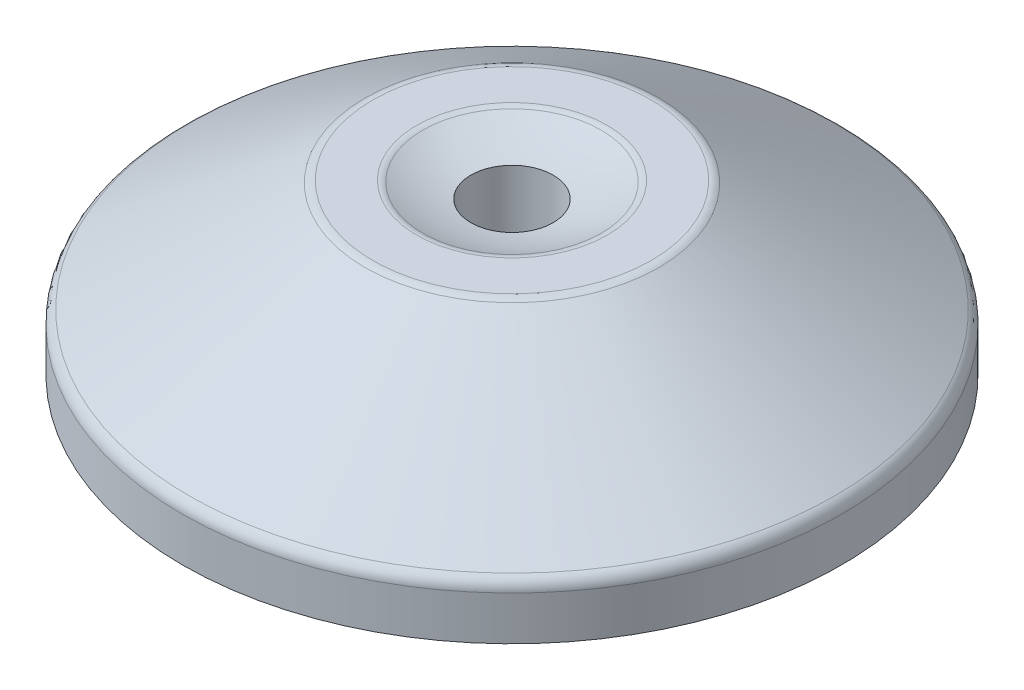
ISO-10303-21;
HEADER;
FILE_DESCRIPTION(('STEP AP214'),'2;1');
FILE_NAME('part.step','',(''),(''),'','','');
FILE_SCHEMA(('AUTOMOTIVE_DESIGN { 1 0 10303 214 1 1 1 1 }'));
ENDSEC;
DATA;
#1=APPLICATION_CONTEXT('core data for automotive mechanical design processes');
#2=APPLICATION_PROTOCOL_DEFINITION('international standard','automotive_design',2000,#1);
#3=PRODUCT_CONTEXT('',#1,'mechanical');
#4=PRODUCT('Part','Part','',(#3));
#5=PRODUCT_RELATED_PRODUCT_CATEGORY('part','',(#4));
#6=PRODUCT_DEFINITION_FORMATION('','',#4);
#7=PRODUCT_DEFINITION_CONTEXT('part definition',#1,'design');
#8=PRODUCT_DEFINITION('design','',#6,#7);
#9=PRODUCT_DEFINITION_SHAPE('','',#8);
#10=(LENGTH_UNIT() NAMED_UNIT(*) SI_UNIT(.MILLI.,.METRE.));
#11=(NAMED_UNIT(*) PLANE_ANGLE_UNIT() SI_UNIT($,.RADIAN.));
#12=(NAMED_UNIT(*) SI_UNIT($,.STERADIAN.) SOLID_ANGLE_UNIT());
#13=UNCERTAINTY_MEASURE_WITH_UNIT(LENGTH_MEASURE(1.E-05),#10,'distance_accuracy_value','');
#14=(GEOMETRIC_REPRESENTATION_CONTEXT(3) GLOBAL_UNCERTAINTY_ASSIGNED_CONTEXT((#13)) GLOBAL_UNIT_ASSIGNED_CONTEXT((#10,
#11,#12)) REPRESENTATION_CONTEXT('',''));
#15=CARTESIAN_POINT('',(0.,0.,0.));
#16=DIRECTION('',(0.,0.,1.));
#17=DIRECTION('',(1.,0.,0.));
#18=AXIS2_PLACEMENT_3D('',#15,#16,#17);
#19=CARTESIAN_POINT('',(14.6875,12.5447967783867,0.));
#20=DIRECTION('',(0.,-1.,0.));
#21=DIRECTION('',(0.,0.,-1.));
#22=AXIS2_PLACEMENT_3D('',#19,#20,#21);
#23=PLANE('',#22);
#24=CARTESIAN_POINT('',(0.,12.5447967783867,0.));
#25=DIRECTION('',(0.,-1.,0.));
#26=DIRECTION('',(0.,0.,-1.));
#27=AXIS2_PLACEMENT_3D('',#24,#25,#26);
#28=CIRCLE('',#27,8.37499999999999);
#29=CARTESIAN_POINT('',(0.,12.5447967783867,-8.37499999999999));
#30=VERTEX_POINT('',#29);
#31=EDGE_CURVE('E18',#30,#30,#28,.T.);
#32=ORIENTED_EDGE('',*,*,#31,.F.);
#33=EDGE_LOOP('',(#32));
#34=FACE_BOUND('',#33,.T.);
#35=CARTESIAN_POINT('',(0.,12.5447967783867,0.));
#36=DIRECTION('',(0.,-1.,0.));
#37=DIRECTION('',(0.,0.,-1.));
#38=AXIS2_PLACEMENT_3D('',#35,#36,#37);
#39=CIRCLE('',#38,21.);
#40=CARTESIAN_POINT('',(0.,12.5447967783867,-21.));
#41=VERTEX_POINT('',#40);
#42=EDGE_CURVE('E91',#41,#41,#39,.F.);
#43=ORIENTED_EDGE('',*,*,#42,.F.);
#44=EDGE_LOOP('',(#43));
#45=FACE_BOUND('',#44,.T.);
#46=ADVANCED_FACE('F14',(#34,#45),#23,.T.);
#47=CARTESIAN_POINT('',(0.,12.5447967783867,0.));
#48=DIRECTION('',(0.,-1.,0.));
#49=DIRECTION('',(0.,0.,-1.));
#50=AXIS2_PLACEMENT_3D('',#47,#48,#49);
#51=TOROIDAL_SURFACE('',#50,5.62499999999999,2.75);
#52=ORIENTED_EDGE('',*,*,#31,.T.);
#53=EDGE_LOOP('',(#52));
#54=FACE_BOUND('',#53,.T.);
#55=CARTESIAN_POINT('',(0.,9.79479677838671,0.));
#56=DIRECTION('',(0.,-1.,0.));
#57=DIRECTION('',(0.,0.,-1.));
#58=AXIS2_PLACEMENT_3D('',#55,#56,#57);
#59=CIRCLE('',#58,5.62499999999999);
#60=CARTESIAN_POINT('',(0.,9.79479677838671,-5.62499999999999));
#61=VERTEX_POINT('',#60);
#62=EDGE_CURVE('E86',#61,#61,#59,.F.);
#63=ORIENTED_EDGE('',*,*,#62,.T.);
#64=EDGE_LOOP('',(#63));
#65=FACE_BOUND('',#64,.T.);
#66=ADVANCED_FACE('F99',(#54,#65),#51,.T.);
#67=CARTESIAN_POINT('',(0.,-13.0000726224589,0.));
#68=DIRECTION('',(0.,-1.,0.));
#69=DIRECTION('',(0.,0.,-1.));
#70=AXIS2_PLACEMENT_3D('',#67,#68,#69);
#71=DEGENERATE_TOROIDAL_SURFACE('',#70,12.248537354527,27.0023786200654,.T.);
#72=CARTESIAN_POINT('',(0.,3.,0.));
#73=DIRECTION('',(0.,-1.,0.));
#74=DIRECTION('',(0.,0.,-1.));
#75=AXIS2_PLACEMENT_3D('',#72,#73,#74);
#76=CIRCLE('',#75,34.);
#77=CARTESIAN_POINT('',(0.,3.,-34.));
#78=VERTEX_POINT('',#77);
#79=EDGE_CURVE('E77',#78,#78,#76,.T.);
#80=ORIENTED_EDGE('',*,*,#79,.T.);
#81=EDGE_LOOP('',(#80));
#82=FACE_BOUND('',#81,.T.);
#83=ORIENTED_EDGE('',*,*,#42,.T.);
#84=EDGE_LOOP('',(#83));
#85=FACE_BOUND('',#84,.T.);
#86=ADVANCED_FACE('F16',(#82,#85),#71,.F.);
#87=CARTESIAN_POINT('',(0.,15.2947967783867,0.));
#88=DIRECTION('',(0.,-1.,0.));
#89=DIRECTION('',(0.,0.,-1.));
#90=AXIS2_PLACEMENT_3D('',#87,#88,#89);
#91=CYLINDRICAL_SURFACE('',#90,5.62499999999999);
#92=ORIENTED_EDGE('',*,*,#62,.F.);
#93=EDGE_LOOP('',(#92));
#94=FACE_BOUND('',#93,.T.);
#95=CARTESIAN_POINT('',(0.,20.7947967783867,0.));
#96=DIRECTION('',(0.,-1.,0.));
#97=DIRECTION('',(0.,0.,-1.));
#98=AXIS2_PLACEMENT_3D('',#95,#96,#97);
#99=CIRCLE('',#98,5.62499999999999);
#100=CARTESIAN_POINT('',(0.,20.7947967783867,-5.62499999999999));
#101=VERTEX_POINT('',#100);
#102=EDGE_CURVE('E85',#101,#101,#99,.T.);
#103=ORIENTED_EDGE('',*,*,#102,.F.);
#104=EDGE_LOOP('',(#103));
#105=FACE_BOUND('',#104,.T.);
#106=ADVANCED_FACE('F103',(#94,#105),#91,.F.);
#107=CARTESIAN_POINT('',(0.,1.5,0.));
#108=DIRECTION('',(0.,-1.,0.));
#109=DIRECTION('',(0.,0.,-1.));
#110=AXIS2_PLACEMENT_3D('',#107,#108,#109);
#111=CYLINDRICAL_SURFACE('',#110,34.);
#112=CARTESIAN_POINT('',(0.,0.,0.));
#113=DIRECTION('',(0.,-1.,0.));
#114=DIRECTION('',(0.,0.,-1.));
#115=AXIS2_PLACEMENT_3D('',#112,#113,#114);
#116=CIRCLE('',#115,34.);
#117=CARTESIAN_POINT('',(0.,0.,-34.));
#118=VERTEX_POINT('',#117);
#119=EDGE_CURVE('E164',#118,#118,#116,.F.);
#120=ORIENTED_EDGE('',*,*,#119,.F.);
#121=EDGE_LOOP('',(#120));
#122=FACE_BOUND('',#121,.T.);
#123=ORIENTED_EDGE('',*,*,#79,.F.);
#124=EDGE_LOOP('',(#123));
#125=FACE_BOUND('',#124,.T.);
#126=ADVANCED_FACE('F179',(#122,#125),#111,.F.);
#127=CARTESIAN_POINT('',(-11.3274938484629,25.3562402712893,-12.4182138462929));
#128=CARTESIAN_POINT('',(-11.2256653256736,25.3114638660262,-12.4182138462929));
#129=CARTESIAN_POINT('',(-11.1238368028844,25.2666874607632,-12.4182138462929));
#130=CARTESIAN_POINT('',(0.,20.3752738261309,-12.4182138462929));
#131=CARTESIAN_POINT('',(11.1238368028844,25.2666874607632,-12.4182138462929));
#132=CARTESIAN_POINT('',(11.2256653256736,25.3114638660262,-12.4182138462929));
#133=CARTESIAN_POINT('',(11.3274938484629,25.3562402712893,-12.4182138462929));
#134=CARTESIAN_POINT('',(-11.3476147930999,25.3114638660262,-12.3065802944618));
#135=CARTESIAN_POINT('',(-11.2456053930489,25.2666079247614,-12.3065802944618));
#136=CARTESIAN_POINT('',(-11.143595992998,25.2217519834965,-12.3065802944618));
#137=CARTESIAN_POINT('',(0.,20.3216497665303,-12.3065802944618));
#138=CARTESIAN_POINT('',(11.143595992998,25.2217519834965,-12.3065802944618));
#139=CARTESIAN_POINT('',(11.245605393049,25.2666079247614,-12.3065802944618));
#140=CARTESIAN_POINT('',(11.3476147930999,25.3114638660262,-12.3065802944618));
#141=CARTESIAN_POINT('',(-11.367735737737,25.2666874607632,-12.1949467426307));
#142=CARTESIAN_POINT('',(-11.2655454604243,25.2217519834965,-12.1949467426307));
#143=CARTESIAN_POINT('',(-11.1633551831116,25.1768165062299,-12.1949467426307));
#144=CARTESIAN_POINT('',(0.,20.2680257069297,-12.1949467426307));
#145=CARTESIAN_POINT('',(11.1633551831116,25.1768165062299,-12.1949467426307));
#146=CARTESIAN_POINT('',(11.2655454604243,25.2217519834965,-12.1949467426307));
#147=CARTESIAN_POINT('',(11.367735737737,25.2666874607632,-12.1949467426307));
#148=CARTESIAN_POINT('',(-13.5657653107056,20.3752738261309,0.));
#149=CARTESIAN_POINT('',(-13.4438158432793,20.3216497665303,0.));
#150=CARTESIAN_POINT('',(-13.321866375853,20.2680257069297,0.));
#151=CARTESIAN_POINT('',(0.,14.4100865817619,0.));
#152=CARTESIAN_POINT('',(13.321866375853,20.2680257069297,0.));
#153=CARTESIAN_POINT('',(13.4438158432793,20.3216497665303,0.));
#154=CARTESIAN_POINT('',(13.5657653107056,20.3752738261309,0.));
#155=CARTESIAN_POINT('',(-11.367735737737,25.2666874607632,12.1949467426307));
#156=CARTESIAN_POINT('',(-11.2655454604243,25.2217519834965,12.1949467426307));
#157=CARTESIAN_POINT('',(-11.1633551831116,25.1768165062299,12.1949467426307));
#158=CARTESIAN_POINT('',(0.,20.2680257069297,12.1949467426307));
#159=CARTESIAN_POINT('',(11.1633551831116,25.1768165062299,12.1949467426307));
#160=CARTESIAN_POINT('',(11.2655454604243,25.2217519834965,12.1949467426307));
#161=CARTESIAN_POINT('',(11.367735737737,25.2666874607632,12.1949467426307));
#162=CARTESIAN_POINT('',(-11.3476147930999,25.3114638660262,12.3065802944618));
#163=CARTESIAN_POINT('',(-11.2456053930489,25.2666079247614,12.3065802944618));
#164=CARTESIAN_POINT('',(-11.143595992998,25.2217519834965,12.3065802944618));
#165=CARTESIAN_POINT('',(0.,20.3216497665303,12.3065802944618));
#166=CARTESIAN_POINT('',(11.143595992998,25.2217519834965,12.3065802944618));
#167=CARTESIAN_POINT('',(11.245605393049,25.2666079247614,12.3065802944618));
#168=CARTESIAN_POINT('',(11.3476147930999,25.3114638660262,12.3065802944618));
#169=CARTESIAN_POINT('',(-11.3274938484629,25.3562402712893,12.4182138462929));
#170=CARTESIAN_POINT('',(-11.2256653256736,25.3114638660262,12.4182138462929));
#171=CARTESIAN_POINT('',(-11.1238368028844,25.2666874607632,12.4182138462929));
#172=CARTESIAN_POINT('',(0.,20.3752738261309,12.4182138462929));
#173=CARTESIAN_POINT('',(11.1238368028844,25.2666874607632,12.4182138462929));
#174=CARTESIAN_POINT('',(11.2256653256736,25.3114638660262,12.4182138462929));
#175=CARTESIAN_POINT('',(11.3274938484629,25.3562402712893,12.4182138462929));
#176=(BOUNDED_SURFACE() B_SPLINE_SURFACE(2,2,((#127,#128,#129,#130,#131,#132,#133),(#134,#135,
#136,#137,#138,#139,#140),(#141,#142,#143,#144,#145,#146,#147),(#148,#149,#150,#151,#152,#153,
#154),(#155,#156,#157,#158,#159,#160,#161),(#162,#163,#164,#165,#166,#167,#168),(#169,#170,#171,
#172,#173,#174,#175)),.UNSPECIFIED.,.F.,.F.,.F.) B_SPLINE_SURFACE_WITH_KNOTS((3,2,2,3),(3,2,2,
3),(-0.422560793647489,-0.414275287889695,0.414275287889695,0.422560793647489),
(-0.00828550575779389,0.,0.828550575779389,0.836836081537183),
.UNSPECIFIED.) GEOMETRIC_REPRESENTATION_ITEM() RATIONAL_B_SPLINE_SURFACE(((1.,1.,1.,
0.915408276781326,1.,1.,1.),(1.,1.,1.,0.915408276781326,1.,1.,1.),(1.,1.,1.,0.915408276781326,
1.,1.,1.),(0.915408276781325,0.915408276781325,0.915408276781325,0.837972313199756,
0.915408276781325,0.915408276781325,0.915408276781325),(1.,1.,1.,0.915408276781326,1.,1.,1.),
(1.,1.,1.,0.915408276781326,1.,1.,1.),(1.,1.,1.,0.915408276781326,1.,1.,1.))) REPRESENTATION_ITEM('') SURFACE());
#177=CARTESIAN_POINT('',(0.,22.8308165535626,0.));
#178=DIRECTION('',(0.,-1.,0.));
#179=DIRECTION('',(0.,0.,-1.));
#180=AXIS2_PLACEMENT_3D('',#177,#178,#179);
#181=CIRCLE('',#180,12.1949467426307);
#182=CARTESIAN_POINT('',(0.,22.8308165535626,-12.1949467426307));
#183=VERTEX_POINT('',#182);
#184=EDGE_CURVE('E162',#183,#183,#181,.T.);
#185=ORIENTED_EDGE('',*,*,#102,.T.);
#186=EDGE_LOOP('',(#185));
#187=FACE_BOUND('',#186,.T.);
#188=ORIENTED_EDGE('',*,*,#184,.F.);
#189=EDGE_LOOP('',(#188));
#190=FACE_BOUND('',#189,.T.);
#191=ADVANCED_FACE('F182',(#187,#190),#176,.T.);
#192=CARTESIAN_POINT('',(39.5,0.,0.));
#193=DIRECTION('',(0.,-1.,0.));
#194=DIRECTION('',(0.,0.,-1.));
#195=AXIS2_PLACEMENT_3D('',#192,#193,#194);
#196=PLANE('',#195);
#197=ORIENTED_EDGE('',*,*,#119,.T.);
#198=EDGE_LOOP('',(#197));
#199=FACE_BOUND('',#198,.T.);
#200=CARTESIAN_POINT('',(0.,0.,0.));
#201=DIRECTION('',(0.,-1.,0.));
#202=DIRECTION('',(0.,0.,-1.));
#203=AXIS2_PLACEMENT_3D('',#200,#201,#202);
#204=CIRCLE('',#203,45.);
#205=CARTESIAN_POINT('',(0.,0.,-45.));
#206=VERTEX_POINT('',#205);
#207=EDGE_CURVE('E96',#206,#206,#204,.F.);
#208=ORIENTED_EDGE('',*,*,#207,.F.);
#209=EDGE_LOOP('',(#208));
#210=FACE_BOUND('',#209,.T.);
#211=ADVANCED_FACE('F71',(#199,#210),#196,.T.);
#212=CARTESIAN_POINT('',(0.,21.,0.));
#213=DIRECTION('',(0.,-1.,0.));
#214=DIRECTION('',(0.,0.,-1.));
#215=AXIS2_PLACEMENT_3D('',#212,#213,#214);
#216=TOROIDAL_SURFACE('',#215,13.,2.);
#217=ORIENTED_EDGE('',*,*,#184,.T.);
#218=EDGE_LOOP('',(#217));
#219=FACE_BOUND('',#218,.T.);
#220=CARTESIAN_POINT('',(0.,23.,0.));
#221=DIRECTION('',(0.,1.,0.));
#222=DIRECTION('',(1.,0.,0.));
#223=AXIS2_PLACEMENT_3D('',#220,#221,#222);
#224=CIRCLE('',#223,13.);
#225=CARTESIAN_POINT('',(13.,23.,0.));
#226=VERTEX_POINT('',#225);
#227=EDGE_CURVE('E125',#226,#226,#224,.F.);
#228=ORIENTED_EDGE('',*,*,#227,.F.);
#229=EDGE_LOOP('',(#228));
#230=FACE_BOUND('',#229,.T.);
#231=ADVANCED_FACE('F65',(#219,#230),#216,.T.);
#232=CARTESIAN_POINT('',(0.,3.,0.));
#233=DIRECTION('',(0.,-1.,0.));
#234=DIRECTION('',(0.,0.,-1.));
#235=AXIS2_PLACEMENT_3D('',#232,#233,#234);
#236=CYLINDRICAL_SURFACE('',#235,45.);
#237=CARTESIAN_POINT('',(0.,6.,0.));
#238=DIRECTION('',(0.,-1.,0.));
#239=DIRECTION('',(0.,0.,-1.));
#240=AXIS2_PLACEMENT_3D('',#237,#238,#239);
#241=CIRCLE('',#240,45.);
#242=CARTESIAN_POINT('',(0.,6.,-45.));
#243=VERTEX_POINT('',#242);
#244=EDGE_CURVE('E123',#243,#243,#241,.F.);
#245=ORIENTED_EDGE('',*,*,#244,.F.);
#246=EDGE_LOOP('',(#245));
#247=FACE_BOUND('',#246,.T.);
#248=ORIENTED_EDGE('',*,*,#207,.T.);
#249=EDGE_LOOP('',(#248));
#250=FACE_BOUND('',#249,.T.);
#251=ADVANCED_FACE('F70',(#247,#250),#236,.T.);
#252=CARTESIAN_POINT('',(16.,23.,0.));
#253=DIRECTION('',(0.,1.,0.));
#254=DIRECTION('',(0.,0.,1.));
#255=AXIS2_PLACEMENT_3D('',#252,#253,#254);
#256=PLANE('',#255);
#257=ORIENTED_EDGE('',*,*,#227,.T.);
#258=EDGE_LOOP('',(#257));
#259=FACE_BOUND('',#258,.T.);
#260=CARTESIAN_POINT('',(0.,23.,0.));
#261=DIRECTION('',(0.,-1.,0.));
#262=DIRECTION('',(1.,0.,0.));
#263=AXIS2_PLACEMENT_3D('',#260,#261,#262);
#264=CIRCLE('',#263,19.);
#265=CARTESIAN_POINT('',(19.,23.,0.));
#266=VERTEX_POINT('',#265);
#267=EDGE_CURVE('E27',#266,#266,#264,.T.);
#268=ORIENTED_EDGE('',*,*,#267,.F.);
#269=EDGE_LOOP('',(#268));
#270=FACE_BOUND('',#269,.T.);
#271=ADVANCED_FACE('F120',(#259,#270),#256,.T.);
#272=CARTESIAN_POINT('',(0.,6.,0.));
#273=DIRECTION('',(0.,-1.,0.));
#274=DIRECTION('',(0.,0.,-1.));
#275=AXIS2_PLACEMENT_3D('',#272,#273,#274);
#276=TOROIDAL_SURFACE('',#275,43.,2.00000000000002);
#277=CARTESIAN_POINT('',(0.,7.69599659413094,0.));
#278=DIRECTION('',(0.,-1.,0.));
#279=DIRECTION('',(1.,0.,0.));
#280=AXIS2_PLACEMENT_3D('',#277,#278,#279);
#281=CIRCLE('',#280,44.0599978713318);
#282=CARTESIAN_POINT('',(44.0599978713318,7.69599659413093,0.));
#283=VERTEX_POINT('',#282);
#284=EDGE_CURVE('E22',#283,#283,#281,.F.);
#285=ORIENTED_EDGE('',*,*,#284,.F.);
#286=EDGE_LOOP('',(#285));
#287=FACE_BOUND('',#286,.T.);
#288=ORIENTED_EDGE('',*,*,#244,.T.);
#289=EDGE_LOOP('',(#288));
#290=FACE_BOUND('',#289,.T.);
#291=ADVANCED_FACE('F45',(#287,#290),#276,.T.);
#292=CARTESIAN_POINT('',(0.,21.,0.));
#293=DIRECTION('',(0.,-1.,0.));
#294=DIRECTION('',(0.,0.,-1.));
#295=AXIS2_PLACEMENT_3D('',#292,#293,#294);
#296=TOROIDAL_SURFACE('',#295,19.,2.);
#297=ORIENTED_EDGE('',*,*,#267,.T.);
#298=EDGE_LOOP('',(#297));
#299=FACE_BOUND('',#298,.T.);
#300=CARTESIAN_POINT('',(0.,22.6959966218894,0.));
#301=DIRECTION('',(0.,-1.,0.));
#302=DIRECTION('',(1.,0.,0.));
#303=AXIS2_PLACEMENT_3D('',#300,#301,#302);
#304=CIRCLE('',#303,20.0599978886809);
#305=CARTESIAN_POINT('',(20.0599978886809,22.6959966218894,0.));
#306=VERTEX_POINT('',#305);
#307=EDGE_CURVE('E10',#306,#306,#304,.T.);
#308=ORIENTED_EDGE('',*,*,#307,.F.);
#309=EDGE_LOOP('',(#308));
#310=FACE_BOUND('',#309,.T.);
#311=ADVANCED_FACE('F39',(#299,#310),#296,.T.);
#312=CARTESIAN_POINT('',(0.,7.69599659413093,0.));
#313=DIRECTION('',(0.,-1.,0.));
#314=DIRECTION('',(0.,0.,-1.));
#315=AXIS2_PLACEMENT_3D('',#312,#313,#314);
#316=CONICAL_SURFACE('',#315,44.0599978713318,1.01219701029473);
#317=ORIENTED_EDGE('',*,*,#307,.T.);
#318=EDGE_LOOP('',(#317));
#319=FACE_BOUND('',#318,.T.);
#320=ORIENTED_EDGE('',*,*,#284,.T.);
#321=EDGE_LOOP('',(#320));
#322=FACE_BOUND('',#321,.T.);
#323=ADVANCED_FACE('F44',(#319,#322),#316,.T.);
#324=CLOSED_SHELL('',(#46,#66,#86,#106,#126,#191,#211,#231,#251,#271,#291,#311,#323));
#325=MANIFOLD_SOLID_BREP('B1',#324);
#326=ADVANCED_BREP_SHAPE_REPRESENTATION('',(#18,#325),#14);
#327=SHAPE_DEFINITION_REPRESENTATION(#9,#326);
ENDSEC;
END-ISO-10303-21;
